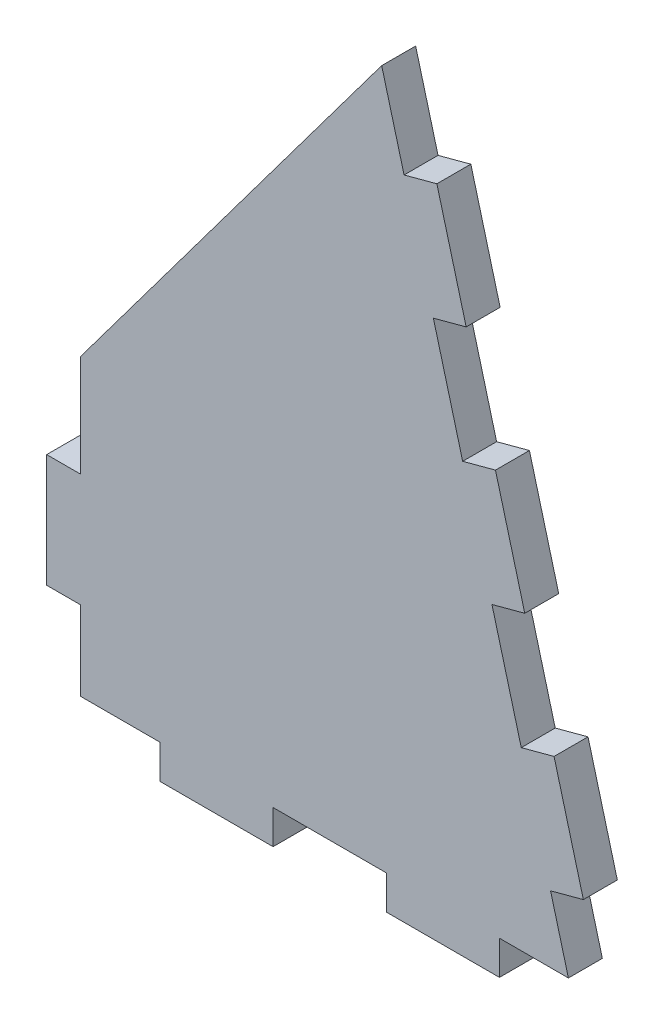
from build123d import *

# Parameters (mm, degrees)
BOSS_EXTRUDE1_DEPTH = 3
CUT_EXTRUDE1_DEPTH  = 3
SKETCH3_W           = 10
SKETCH3_H           = 3
CUT_EXTRUDE2_DEPTH  = 3
SKETCH4_W           = 3
SKETCH4_H           = 10
CUT_EXTRUDE3_DEPTH  = 3


with BuildPart() as part:
    # Sketch1 → Boss-Extrude1 (new body)
    with BuildSketch(Plane.XY):
        Polygon((0, 0), (50, 0), (31.882666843, 67.61480784), (0, 25), align=None)
    extrude(amount=-BOSS_EXTRUDE1_DEPTH)

    # Sketch2 → Cut-Extrude1 (cut)
    with BuildSketch(Plane.XY):
        Polygon((31.882666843, 67.61480784), (34.470857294, 57.955549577), (31.573079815, 57.179092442), (28.984889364, 66.838350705), align=None)
        Polygon((37.059047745, 48.296291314), (39.647238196, 38.637033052), (36.749460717, 37.860575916), (34.161270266, 47.519834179), align=None)
        Polygon((42.235428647, 28.977774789), (44.823619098, 19.318516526), (41.925841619, 18.54205939), (39.337651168, 28.201317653), align=None)
        Polygon((47.411809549, 9.659258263), (50, 0), (47.102222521, -0.776457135), (44.51403207, 8.882801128), align=None)
    extrude(amount=-CUT_EXTRUDE1_DEPTH, mode=Mode.SUBTRACT)

    # Sketch3 → Cut-Extrude2 (cut)
    with BuildSketch(Plane.XY):
        with Locations((25, 1.5)):
            Rectangle(SKETCH3_W, SKETCH3_H)
        with Locations((5, 1.5)):
            Rectangle(SKETCH3_W, SKETCH3_H)
        with Locations((45, 1.5)):
            Rectangle(SKETCH3_W, SKETCH3_H)
    extrude(amount=-CUT_EXTRUDE2_DEPTH, mode=Mode.SUBTRACT)

    # Sketch4 → Cut-Extrude3 (cut)
    with BuildSketch(Plane.XY):
        with Locations((1.5, 25)):
            Rectangle(SKETCH4_W, SKETCH4_H)
        with Locations((1.5, 5)):
            Rectangle(SKETCH4_W, SKETCH4_H)
    extrude(amount=-CUT_EXTRUDE3_DEPTH, mode=Mode.SUBTRACT)


solid = part.part
